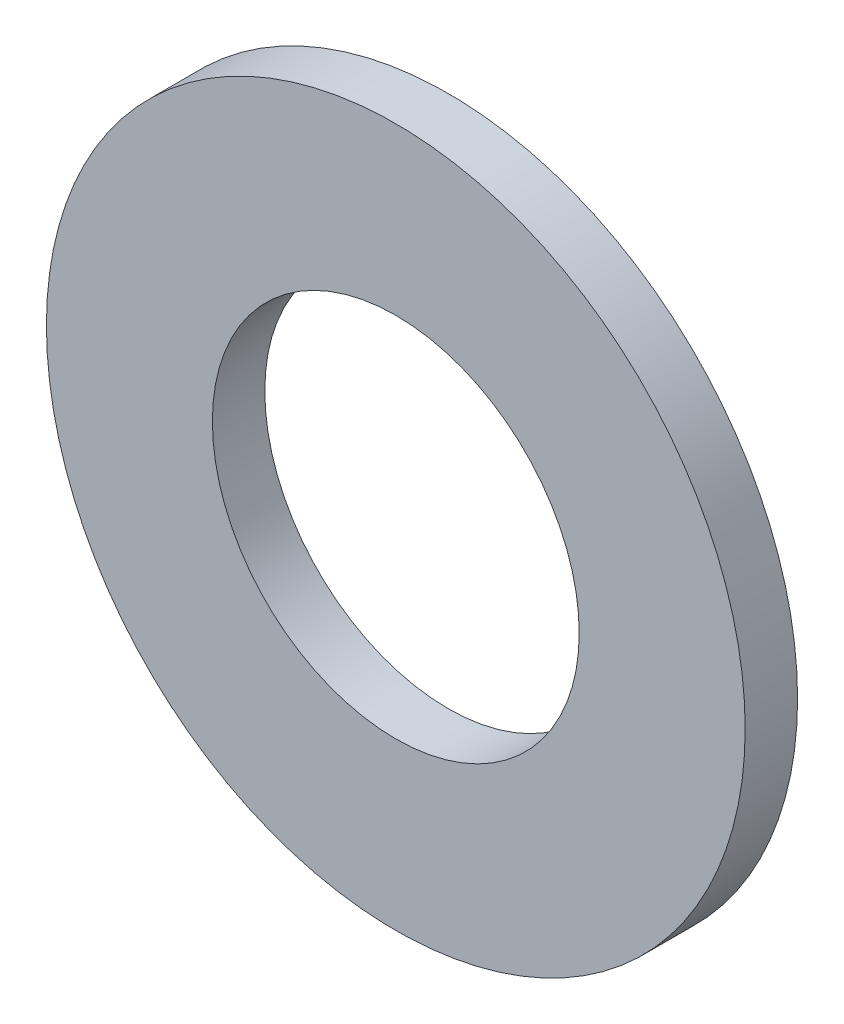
from build123d import *

# Parameters (mm, degrees)
E_CORPS_R              = 20
CORPS_DEPTH            = 3
E_PER_AGE_R            = 10.5
DIAM_TRE_NOMINAL_DEPTH = 29.442925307


with BuildPart() as part:
    # E_corps → Corps (new body)
    with BuildSketch(Plane.XY):
        Circle(E_CORPS_R)
    extrude(amount=CORPS_DEPTH)

    # E_per_age → Diam_tre_nominal (cut, through all)
    with BuildSketch(Plane(origin=(0, 0, 0), x_dir=(-1, 0, 0), z_dir=(0, 0, -1))):
        Circle(E_PER_AGE_R)
    extrude(amount=-DIAM_TRE_NOMINAL_DEPTH, mode=Mode.SUBTRACT)


solid = part.part
